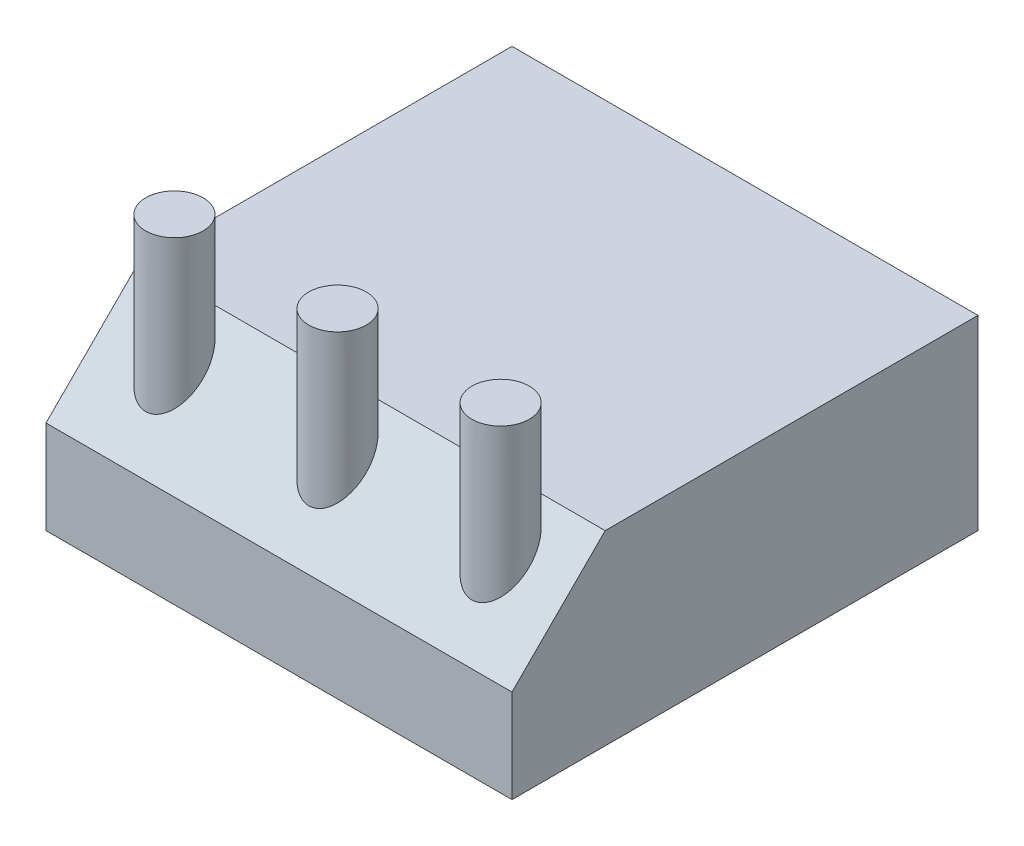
ISO-10303-21;
HEADER;
FILE_DESCRIPTION(('STEP AP214'),'2;1');
FILE_NAME('part.step','',(''),(''),'','','');
FILE_SCHEMA(('AUTOMOTIVE_DESIGN { 1 0 10303 214 1 1 1 1 }'));
ENDSEC;
DATA;
#1=APPLICATION_CONTEXT('core data for automotive mechanical design processes');
#2=APPLICATION_PROTOCOL_DEFINITION('international standard','automotive_design',2000,#1);
#3=PRODUCT_CONTEXT('',#1,'mechanical');
#4=PRODUCT('Part','Part','',(#3));
#5=PRODUCT_RELATED_PRODUCT_CATEGORY('part','',(#4));
#6=PRODUCT_DEFINITION_FORMATION('','',#4);
#7=PRODUCT_DEFINITION_CONTEXT('part definition',#1,'design');
#8=PRODUCT_DEFINITION('design','',#6,#7);
#9=PRODUCT_DEFINITION_SHAPE('','',#8);
#10=(LENGTH_UNIT() NAMED_UNIT(*) SI_UNIT(.MILLI.,.METRE.));
#11=(NAMED_UNIT(*) PLANE_ANGLE_UNIT() SI_UNIT($,.RADIAN.));
#12=(NAMED_UNIT(*) SI_UNIT($,.STERADIAN.) SOLID_ANGLE_UNIT());
#13=UNCERTAINTY_MEASURE_WITH_UNIT(LENGTH_MEASURE(1.E-05),#10,'distance_accuracy_value','');
#14=(GEOMETRIC_REPRESENTATION_CONTEXT(3) GLOBAL_UNCERTAINTY_ASSIGNED_CONTEXT((#13)) GLOBAL_UNIT_ASSIGNED_CONTEXT((#10,
#11,#12)) REPRESENTATION_CONTEXT('',''));
#15=CARTESIAN_POINT('',(0.,0.,0.));
#16=DIRECTION('',(0.,0.,1.));
#17=DIRECTION('',(1.,0.,0.));
#18=AXIS2_PLACEMENT_3D('',#15,#16,#17);
#19=CARTESIAN_POINT('',(-25.,20.,-25.));
#20=DIRECTION('',(0.,1.,0.));
#21=DIRECTION('',(0.,0.,1.));
#22=AXIS2_PLACEMENT_3D('',#19,#20,#21);
#23=PLANE('',#22);
#24=DIRECTION('',(0.,0.,1.));
#25=VECTOR('',#24,1.);
#26=CARTESIAN_POINT('',(-25.,20.,-25.));
#27=LINE('',#26,#25);
#28=CARTESIAN_POINT('',(-25.,20.,-25.));
#29=VERTEX_POINT('',#28);
#30=CARTESIAN_POINT('',(-25.,20.,15.));
#31=VERTEX_POINT('',#30);
#32=EDGE_CURVE('E110',#29,#31,#27,.T.);
#33=ORIENTED_EDGE('',*,*,#32,.T.);
#34=DIRECTION('',(1.,0.,0.));
#35=VECTOR('',#34,1.);
#36=CARTESIAN_POINT('',(25.,20.,15.));
#37=LINE('',#36,#35);
#38=CARTESIAN_POINT('',(25.,20.,15.));
#39=VERTEX_POINT('',#38);
#40=EDGE_CURVE('E85',#31,#39,#37,.T.);
#41=ORIENTED_EDGE('',*,*,#40,.T.);
#42=DIRECTION('',(0.,0.,-1.));
#43=VECTOR('',#42,1.);
#44=CARTESIAN_POINT('',(25.,20.,-25.));
#45=LINE('',#44,#43);
#46=CARTESIAN_POINT('',(25.,20.,-25.));
#47=VERTEX_POINT('',#46);
#48=EDGE_CURVE('E113',#39,#47,#45,.T.);
#49=ORIENTED_EDGE('',*,*,#48,.T.);
#50=DIRECTION('',(-1.,0.,0.));
#51=VECTOR('',#50,1.);
#52=CARTESIAN_POINT('',(-25.,20.,-25.));
#53=LINE('',#52,#51);
#54=EDGE_CURVE('E115',#47,#29,#53,.T.);
#55=ORIENTED_EDGE('',*,*,#54,.T.);
#56=EDGE_LOOP('',(#33,#41,#49,#55));
#57=FACE_BOUND('',#56,.T.);
#58=ADVANCED_FACE('F32',(#57),#23,.T.);
#59=CARTESIAN_POINT('',(-25.,20.,-25.));
#60=DIRECTION('',(1.,0.,0.));
#61=DIRECTION('',(0.,0.,-1.));
#62=AXIS2_PLACEMENT_3D('',#59,#60,#61);
#63=PLANE('',#62);
#64=DIRECTION('',(0.,-1.,0.));
#65=VECTOR('',#64,1.);
#66=CARTESIAN_POINT('',(-25.,20.,25.));
#67=LINE('',#66,#65);
#68=CARTESIAN_POINT('',(-25.,9.99999999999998,25.));
#69=VERTEX_POINT('',#68);
#70=CARTESIAN_POINT('',(-25.,0.,25.));
#71=VERTEX_POINT('',#70);
#72=EDGE_CURVE('E77',#69,#71,#67,.T.);
#73=ORIENTED_EDGE('',*,*,#72,.F.);
#74=DIRECTION('',(0.,0.707106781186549,-0.707106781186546));
#75=VECTOR('',#74,1.);
#76=CARTESIAN_POINT('',(-25.,20.,15.));
#77=LINE('',#76,#75);
#78=EDGE_CURVE('E11',#69,#31,#77,.T.);
#79=ORIENTED_EDGE('',*,*,#78,.T.);
#80=ORIENTED_EDGE('',*,*,#32,.F.);
#81=DIRECTION('',(0.,-1.,0.));
#82=VECTOR('',#81,1.);
#83=CARTESIAN_POINT('',(-25.,20.,-25.));
#84=LINE('',#83,#82);
#85=CARTESIAN_POINT('',(-25.,0.,-25.));
#86=VERTEX_POINT('',#85);
#87=EDGE_CURVE('E99',#29,#86,#84,.T.);
#88=ORIENTED_EDGE('',*,*,#87,.T.);
#89=DIRECTION('',(0.,0.,1.));
#90=VECTOR('',#89,1.);
#91=CARTESIAN_POINT('',(-25.,0.,-25.));
#92=LINE('',#91,#90);
#93=EDGE_CURVE('E92',#86,#71,#92,.T.);
#94=ORIENTED_EDGE('',*,*,#93,.T.);
#95=EDGE_LOOP('',(#73,#79,#80,#88,#94));
#96=FACE_BOUND('',#95,.T.);
#97=ADVANCED_FACE('F96',(#96),#63,.F.);
#98=CARTESIAN_POINT('',(-25.,20.,25.));
#99=DIRECTION('',(0.,0.,-1.));
#100=DIRECTION('',(-1.,0.,0.));
#101=AXIS2_PLACEMENT_3D('',#98,#99,#100);
#102=PLANE('',#101);
#103=DIRECTION('',(0.,-1.,0.));
#104=VECTOR('',#103,1.);
#105=CARTESIAN_POINT('',(25.,20.,25.));
#106=LINE('',#105,#104);
#107=CARTESIAN_POINT('',(25.,9.99999999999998,25.));
#108=VERTEX_POINT('',#107);
#109=CARTESIAN_POINT('',(25.,0.,25.));
#110=VERTEX_POINT('',#109);
#111=EDGE_CURVE('E86',#108,#110,#106,.T.);
#112=ORIENTED_EDGE('',*,*,#111,.F.);
#113=DIRECTION('',(-1.,0.,0.));
#114=VECTOR('',#113,1.);
#115=CARTESIAN_POINT('',(-25.,9.99999999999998,25.));
#116=LINE('',#115,#114);
#117=EDGE_CURVE('E41',#108,#69,#116,.T.);
#118=ORIENTED_EDGE('',*,*,#117,.T.);
#119=ORIENTED_EDGE('',*,*,#72,.T.);
#120=DIRECTION('',(1.,0.,0.));
#121=VECTOR('',#120,1.);
#122=CARTESIAN_POINT('',(-25.,0.,25.));
#123=LINE('',#122,#121);
#124=EDGE_CURVE('E80',#71,#110,#123,.T.);
#125=ORIENTED_EDGE('',*,*,#124,.T.);
#126=EDGE_LOOP('',(#112,#118,#119,#125));
#127=FACE_BOUND('',#126,.T.);
#128=ADVANCED_FACE('F79',(#127),#102,.F.);
#129=CARTESIAN_POINT('',(25.,20.,-25.));
#130=DIRECTION('',(-1.,0.,0.));
#131=DIRECTION('',(0.,0.,1.));
#132=AXIS2_PLACEMENT_3D('',#129,#130,#131);
#133=PLANE('',#132);
#134=ORIENTED_EDGE('',*,*,#48,.F.);
#135=DIRECTION('',(0.,-0.707106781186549,0.707106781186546));
#136=VECTOR('',#135,1.);
#137=CARTESIAN_POINT('',(25.,20.,15.));
#138=LINE('',#137,#136);
#139=EDGE_CURVE('E56',#39,#108,#138,.T.);
#140=ORIENTED_EDGE('',*,*,#139,.T.);
#141=ORIENTED_EDGE('',*,*,#111,.T.);
#142=DIRECTION('',(0.,0.,-1.));
#143=VECTOR('',#142,1.);
#144=CARTESIAN_POINT('',(25.,0.,-25.));
#145=LINE('',#144,#143);
#146=CARTESIAN_POINT('',(25.,0.,-25.));
#147=VERTEX_POINT('',#146);
#148=EDGE_CURVE('E93',#110,#147,#145,.T.);
#149=ORIENTED_EDGE('',*,*,#148,.T.);
#150=DIRECTION('',(0.,-1.,0.));
#151=VECTOR('',#150,1.);
#152=CARTESIAN_POINT('',(25.,20.,-25.));
#153=LINE('',#152,#151);
#154=EDGE_CURVE('E118',#47,#147,#153,.T.);
#155=ORIENTED_EDGE('',*,*,#154,.F.);
#156=EDGE_LOOP('',(#134,#140,#141,#149,#155));
#157=FACE_BOUND('',#156,.T.);
#158=ADVANCED_FACE('F181',(#157),#133,.F.);
#159=CARTESIAN_POINT('',(-25.,20.,-25.));
#160=DIRECTION('',(0.,0.,1.));
#161=DIRECTION('',(1.,0.,0.));
#162=AXIS2_PLACEMENT_3D('',#159,#160,#161);
#163=PLANE('',#162);
#164=DIRECTION('',(-1.,0.,0.));
#165=VECTOR('',#164,1.);
#166=CARTESIAN_POINT('',(-25.,0.,-25.));
#167=LINE('',#166,#165);
#168=EDGE_CURVE('E108',#147,#86,#167,.T.);
#169=ORIENTED_EDGE('',*,*,#168,.T.);
#170=ORIENTED_EDGE('',*,*,#87,.F.);
#171=ORIENTED_EDGE('',*,*,#54,.F.);
#172=ORIENTED_EDGE('',*,*,#154,.T.);
#173=EDGE_LOOP('',(#169,#170,#171,#172));
#174=FACE_BOUND('',#173,.T.);
#175=ADVANCED_FACE('F178',(#174),#163,.F.);
#176=CARTESIAN_POINT('',(-25.,0.,-25.));
#177=DIRECTION('',(0.,1.,0.));
#178=DIRECTION('',(0.,0.,1.));
#179=AXIS2_PLACEMENT_3D('',#176,#177,#178);
#180=PLANE('',#179);
#181=ORIENTED_EDGE('',*,*,#93,.F.);
#182=ORIENTED_EDGE('',*,*,#168,.F.);
#183=ORIENTED_EDGE('',*,*,#148,.F.);
#184=ORIENTED_EDGE('',*,*,#124,.F.);
#185=EDGE_LOOP('',(#181,#182,#183,#184));
#186=FACE_BOUND('',#185,.T.);
#187=ADVANCED_FACE('F90',(#186),#180,.F.);
#188=CARTESIAN_POINT('',(17.5,30.,18.7197592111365));
#189=DIRECTION('',(0.,-1.,0.));
#190=DIRECTION('',(0.,0.,-1.));
#191=AXIS2_PLACEMENT_3D('',#188,#189,#190);
#192=CYLINDRICAL_SURFACE('',#191,3.07985755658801);
#193=CARTESIAN_POINT('',(17.5,30.,18.7197592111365));
#194=DIRECTION('',(0.,1.,0.));
#195=DIRECTION('',(0.,0.,1.));
#196=AXIS2_PLACEMENT_3D('',#193,#194,#195);
#197=CIRCLE('',#196,3.07985755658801);
#198=CARTESIAN_POINT('',(17.5,30.,21.7996167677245));
#199=VERTEX_POINT('',#198);
#200=EDGE_CURVE('E100',#199,#199,#197,.T.);
#201=ORIENTED_EDGE('',*,*,#200,.F.);
#202=EDGE_LOOP('',(#201));
#203=FACE_BOUND('',#202,.T.);
#204=CARTESIAN_POINT('',(17.5,16.2802407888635,18.7197592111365));
#205=DIRECTION('',(0.,0.707106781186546,0.707106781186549));
#206=DIRECTION('',(0.,-0.707106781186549,0.707106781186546));
#207=AXIS2_PLACEMENT_3D('',#204,#205,#206);
#208=ELLIPSE('',#207,4.35557632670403,3.07985755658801);
#209=CARTESIAN_POINT('',(17.5,13.2003832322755,21.7996167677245));
#210=VERTEX_POINT('',#209);
#211=EDGE_CURVE('E103',#210,#210,#208,.T.);
#212=ORIENTED_EDGE('',*,*,#211,.T.);
#213=EDGE_LOOP('',(#212));
#214=FACE_BOUND('',#213,.T.);
#215=ADVANCED_FACE('F166',(#203,#214),#192,.T.);
#216=CARTESIAN_POINT('',(17.5,30.,18.7197592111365));
#217=DIRECTION('',(0.,1.,0.));
#218=DIRECTION('',(0.,0.,1.));
#219=AXIS2_PLACEMENT_3D('',#216,#217,#218);
#220=PLANE('',#219);
#221=ORIENTED_EDGE('',*,*,#200,.T.);
#222=EDGE_LOOP('',(#221));
#223=FACE_BOUND('',#222,.T.);
#224=ADVANCED_FACE('F158',(#223),#220,.T.);
#225=CARTESIAN_POINT('',(0.,30.,18.7197592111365));
#226=DIRECTION('',(0.,-1.,0.));
#227=DIRECTION('',(0.,0.,-1.));
#228=AXIS2_PLACEMENT_3D('',#225,#226,#227);
#229=CYLINDRICAL_SURFACE('',#228,3.07985755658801);
#230=CARTESIAN_POINT('',(0.,30.,18.7197592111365));
#231=DIRECTION('',(0.,1.,0.));
#232=DIRECTION('',(0.,0.,1.));
#233=AXIS2_PLACEMENT_3D('',#230,#231,#232);
#234=CIRCLE('',#233,3.07985755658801);
#235=CARTESIAN_POINT('',(0.,30.,21.7996167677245));
#236=VERTEX_POINT('',#235);
#237=EDGE_CURVE('E130',#236,#236,#234,.T.);
#238=ORIENTED_EDGE('',*,*,#237,.F.);
#239=EDGE_LOOP('',(#238));
#240=FACE_BOUND('',#239,.T.);
#241=CARTESIAN_POINT('',(0.,16.2802407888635,18.7197592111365));
#242=DIRECTION('',(0.,0.707106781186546,0.707106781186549));
#243=DIRECTION('',(0.,-0.707106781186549,0.707106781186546));
#244=AXIS2_PLACEMENT_3D('',#241,#242,#243);
#245=ELLIPSE('',#244,4.35557632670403,3.07985755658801);
#246=CARTESIAN_POINT('',(0.,13.2003832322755,21.7996167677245));
#247=VERTEX_POINT('',#246);
#248=EDGE_CURVE('E36',#247,#247,#245,.T.);
#249=ORIENTED_EDGE('',*,*,#248,.T.);
#250=EDGE_LOOP('',(#249));
#251=FACE_BOUND('',#250,.T.);
#252=ADVANCED_FACE('F156',(#240,#251),#229,.T.);
#253=CARTESIAN_POINT('',(0.,30.,18.7197592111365));
#254=DIRECTION('',(0.,1.,0.));
#255=DIRECTION('',(0.,0.,1.));
#256=AXIS2_PLACEMENT_3D('',#253,#254,#255);
#257=PLANE('',#256);
#258=ORIENTED_EDGE('',*,*,#237,.T.);
#259=EDGE_LOOP('',(#258));
#260=FACE_BOUND('',#259,.T.);
#261=ADVANCED_FACE('F146',(#260),#257,.T.);
#262=CARTESIAN_POINT('',(-17.5,30.,18.7197592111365));
#263=DIRECTION('',(0.,-1.,0.));
#264=DIRECTION('',(0.,0.,-1.));
#265=AXIS2_PLACEMENT_3D('',#262,#263,#264);
#266=CYLINDRICAL_SURFACE('',#265,3.07985755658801);
#267=CARTESIAN_POINT('',(-17.5,30.,18.7197592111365));
#268=DIRECTION('',(0.,1.,0.));
#269=DIRECTION('',(0.,0.,1.));
#270=AXIS2_PLACEMENT_3D('',#267,#268,#269);
#271=CIRCLE('',#270,3.07985755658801);
#272=CARTESIAN_POINT('',(-17.5,30.,21.7996167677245));
#273=VERTEX_POINT('',#272);
#274=EDGE_CURVE('E128',#273,#273,#271,.T.);
#275=ORIENTED_EDGE('',*,*,#274,.F.);
#276=EDGE_LOOP('',(#275));
#277=FACE_BOUND('',#276,.T.);
#278=CARTESIAN_POINT('',(-17.5,16.2802407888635,18.7197592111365));
#279=DIRECTION('',(0.,0.707106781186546,0.707106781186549));
#280=DIRECTION('',(0.,-0.707106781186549,0.707106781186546));
#281=AXIS2_PLACEMENT_3D('',#278,#279,#280);
#282=ELLIPSE('',#281,4.35557632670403,3.07985755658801);
#283=CARTESIAN_POINT('',(-17.5,13.2003832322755,21.7996167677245));
#284=VERTEX_POINT('',#283);
#285=EDGE_CURVE('E126',#284,#284,#282,.T.);
#286=ORIENTED_EDGE('',*,*,#285,.T.);
#287=EDGE_LOOP('',(#286));
#288=FACE_BOUND('',#287,.T.);
#289=ADVANCED_FACE('F143',(#277,#288),#266,.T.);
#290=CARTESIAN_POINT('',(-17.5,30.,18.7197592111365));
#291=DIRECTION('',(0.,1.,0.));
#292=DIRECTION('',(0.,0.,1.));
#293=AXIS2_PLACEMENT_3D('',#290,#291,#292);
#294=PLANE('',#293);
#295=ORIENTED_EDGE('',*,*,#274,.T.);
#296=EDGE_LOOP('',(#295));
#297=FACE_BOUND('',#296,.T.);
#298=ADVANCED_FACE('F141',(#297),#294,.T.);
#299=CARTESIAN_POINT('',(-25.,20.,15.));
#300=DIRECTION('',(0.,0.707106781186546,0.707106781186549));
#301=DIRECTION('',(0.,-0.707106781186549,0.707106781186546));
#302=AXIS2_PLACEMENT_3D('',#299,#300,#301);
#303=PLANE('',#302);
#304=ORIENTED_EDGE('',*,*,#78,.F.);
#305=ORIENTED_EDGE('',*,*,#117,.F.);
#306=ORIENTED_EDGE('',*,*,#139,.F.);
#307=ORIENTED_EDGE('',*,*,#40,.F.);
#308=EDGE_LOOP('',(#304,#305,#306,#307));
#309=FACE_BOUND('',#308,.T.);
#310=ORIENTED_EDGE('',*,*,#285,.F.);
#311=EDGE_LOOP('',(#310));
#312=FACE_BOUND('',#311,.T.);
#313=ORIENTED_EDGE('',*,*,#211,.F.);
#314=EDGE_LOOP('',(#313));
#315=FACE_BOUND('',#314,.T.);
#316=ORIENTED_EDGE('',*,*,#248,.F.);
#317=EDGE_LOOP('',(#316));
#318=FACE_BOUND('',#317,.T.);
#319=ADVANCED_FACE('F34',(#309,#312,#315,#318),#303,.T.);
#320=CLOSED_SHELL('',(#58,#97,#128,#158,#175,#187,#215,#224,#252,#261,#289,#298,#319));
#321=MANIFOLD_SOLID_BREP('B2',#320);
#322=ADVANCED_BREP_SHAPE_REPRESENTATION('',(#18,#321),#14);
#323=SHAPE_DEFINITION_REPRESENTATION(#9,#322);
ENDSEC;
END-ISO-10303-21;
